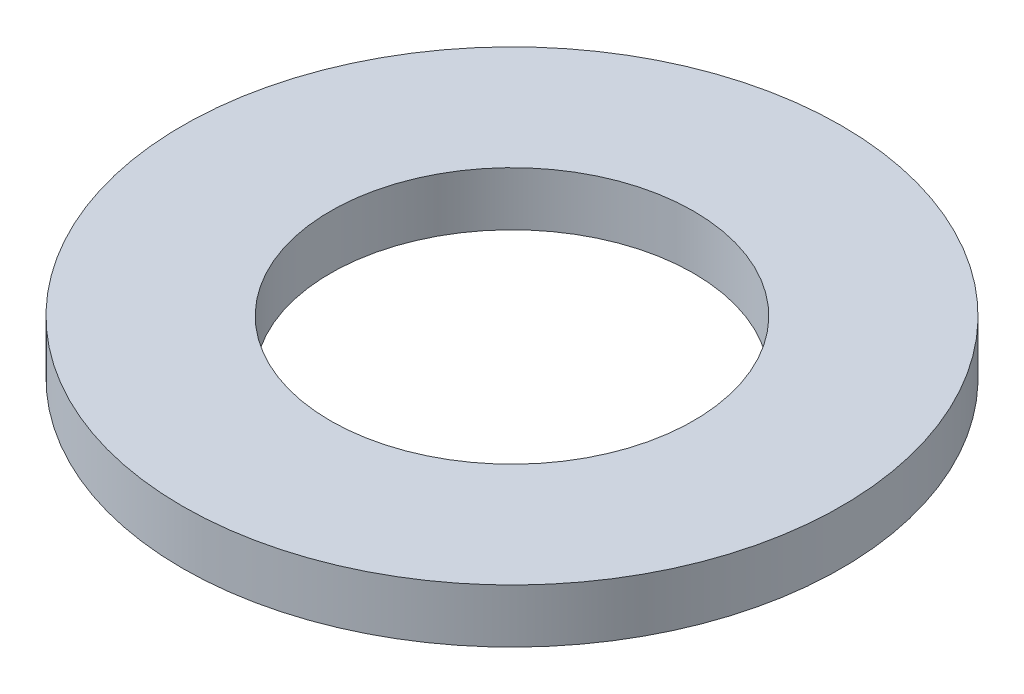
from build123d import *

# Parameters (mm, degrees)
SKETCH1_R      = 49
SKETCH1_R_2    = 27
EXTRUDE1_DEPTH = 8


with BuildPart() as part:
    # Sketch1 → Extrude1 (new body)
    with BuildSketch(Plane(origin=(0, 0, 0), x_dir=(1, 0, 0), z_dir=(0, 1, 0))):
        with Locations(Location((0, 0, 0), (0, 0, 270))):
            Circle(SKETCH1_R)
        with Locations(Location((0, 0, 0), (0, 0, 270))):
            Circle(SKETCH1_R_2, mode=Mode.SUBTRACT)
    extrude(amount=EXTRUDE1_DEPTH)


solid = part.part
